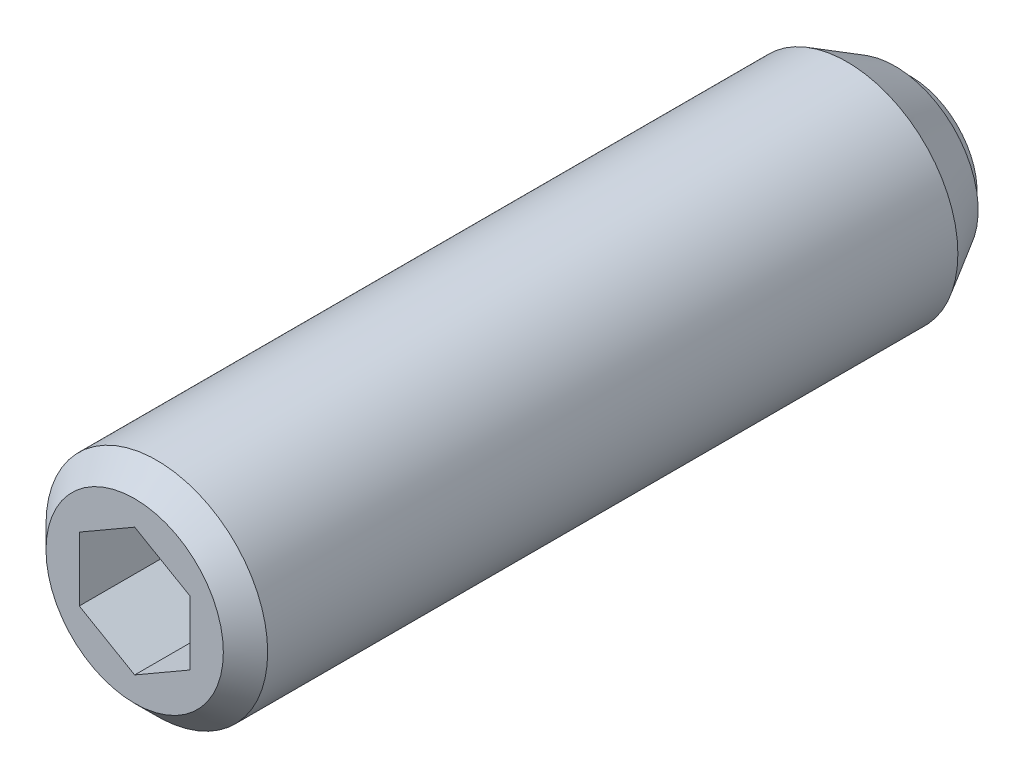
ISO-10303-21;
HEADER;
FILE_DESCRIPTION(('STEP AP214'),'2;1');
FILE_NAME('part.step','',(''),(''),'','','');
FILE_SCHEMA(('AUTOMOTIVE_DESIGN { 1 0 10303 214 1 1 1 1 }'));
ENDSEC;
DATA;
#1=APPLICATION_CONTEXT('core data for automotive mechanical design processes');
#2=APPLICATION_PROTOCOL_DEFINITION('international standard','automotive_design',2000,#1);
#3=PRODUCT_CONTEXT('',#1,'mechanical');
#4=PRODUCT('Part','Part','',(#3));
#5=PRODUCT_RELATED_PRODUCT_CATEGORY('part','',(#4));
#6=PRODUCT_DEFINITION_FORMATION('','',#4);
#7=PRODUCT_DEFINITION_CONTEXT('part definition',#1,'design');
#8=PRODUCT_DEFINITION('design','',#6,#7);
#9=PRODUCT_DEFINITION_SHAPE('','',#8);
#10=(LENGTH_UNIT() NAMED_UNIT(*) SI_UNIT(.MILLI.,.METRE.));
#11=(NAMED_UNIT(*) PLANE_ANGLE_UNIT() SI_UNIT($,.RADIAN.));
#12=(NAMED_UNIT(*) SI_UNIT($,.STERADIAN.) SOLID_ANGLE_UNIT());
#13=UNCERTAINTY_MEASURE_WITH_UNIT(LENGTH_MEASURE(1.E-05),#10,'distance_accuracy_value','');
#14=(GEOMETRIC_REPRESENTATION_CONTEXT(3) GLOBAL_UNCERTAINTY_ASSIGNED_CONTEXT((#13)) GLOBAL_UNIT_ASSIGNED_CONTEXT((#10,
#11,#12)) REPRESENTATION_CONTEXT('',''));
#15=CARTESIAN_POINT('',(0.,0.,0.));
#16=DIRECTION('',(0.,0.,1.));
#17=DIRECTION('',(1.,0.,0.));
#18=AXIS2_PLACEMENT_3D('',#15,#16,#17);
#19=CARTESIAN_POINT('',(2.5,1.44337567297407,32.5));
#20=DIRECTION('',(0.5,0.86602540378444,0.));
#21=DIRECTION('',(0.86602540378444,-0.5,0.));
#22=AXIS2_PLACEMENT_3D('',#19,#20,#21);
#23=PLANE('',#22);
#24=DIRECTION('',(0.,0.,1.));
#25=VECTOR('',#24,1.);
#26=CARTESIAN_POINT('',(2.5,1.44337567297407,32.5));
#27=LINE('',#26,#25);
#28=CARTESIAN_POINT('',(2.5,1.44337567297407,31.));
#29=VERTEX_POINT('',#28);
#30=CARTESIAN_POINT('',(2.5,1.44337567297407,35.));
#31=VERTEX_POINT('',#30);
#32=EDGE_CURVE('E68',#29,#31,#27,.T.);
#33=ORIENTED_EDGE('',*,*,#32,.T.);
#34=DIRECTION('',(-0.86602540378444,0.5,0.));
#35=VECTOR('',#34,1.);
#36=CARTESIAN_POINT('',(2.5,1.44337567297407,35.));
#37=LINE('',#36,#35);
#38=CARTESIAN_POINT('',(0.,2.88675134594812,35.));
#39=VERTEX_POINT('',#38);
#40=EDGE_CURVE('E29',#31,#39,#37,.T.);
#41=ORIENTED_EDGE('',*,*,#40,.T.);
#42=DIRECTION('',(0.,0.,1.));
#43=VECTOR('',#42,1.);
#44=CARTESIAN_POINT('',(0.,2.88675134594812,32.5));
#45=LINE('',#44,#43);
#46=CARTESIAN_POINT('',(0.,2.88675134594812,31.));
#47=VERTEX_POINT('',#46);
#48=EDGE_CURVE('E80',#47,#39,#45,.T.);
#49=ORIENTED_EDGE('',*,*,#48,.F.);
#50=DIRECTION('',(-0.86602540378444,0.5,0.));
#51=VECTOR('',#50,1.);
#52=CARTESIAN_POINT('',(2.5,1.44337567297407,31.));
#53=LINE('',#52,#51);
#54=EDGE_CURVE('E79',#29,#47,#53,.T.);
#55=ORIENTED_EDGE('',*,*,#54,.F.);
#56=EDGE_LOOP('',(#33,#41,#49,#55));
#57=FACE_BOUND('',#56,.T.);
#58=ADVANCED_FACE('F14',(#57),#23,.F.);
#59=CARTESIAN_POINT('',(2.5,-1.44337567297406,32.5));
#60=DIRECTION('',(1.,0.,0.));
#61=DIRECTION('',(0.,-1.,0.));
#62=AXIS2_PLACEMENT_3D('',#59,#60,#61);
#63=PLANE('',#62);
#64=DIRECTION('',(0.,0.,1.));
#65=VECTOR('',#64,1.);
#66=CARTESIAN_POINT('',(2.5,-1.44337567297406,32.5));
#67=LINE('',#66,#65);
#68=CARTESIAN_POINT('',(2.5,-1.44337567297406,31.));
#69=VERTEX_POINT('',#68);
#70=CARTESIAN_POINT('',(2.5,-1.44337567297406,35.));
#71=VERTEX_POINT('',#70);
#72=EDGE_CURVE('E76',#69,#71,#67,.T.);
#73=ORIENTED_EDGE('',*,*,#72,.T.);
#74=DIRECTION('',(0.,1.,0.));
#75=VECTOR('',#74,1.);
#76=CARTESIAN_POINT('',(2.5,-1.44337567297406,35.));
#77=LINE('',#76,#75);
#78=EDGE_CURVE('E75',#71,#31,#77,.T.);
#79=ORIENTED_EDGE('',*,*,#78,.T.);
#80=ORIENTED_EDGE('',*,*,#32,.F.);
#81=DIRECTION('',(0.,1.,0.));
#82=VECTOR('',#81,1.);
#83=CARTESIAN_POINT('',(2.5,-1.44337567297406,31.));
#84=LINE('',#83,#82);
#85=EDGE_CURVE('E72',#69,#29,#84,.T.);
#86=ORIENTED_EDGE('',*,*,#85,.F.);
#87=EDGE_LOOP('',(#73,#79,#80,#86));
#88=FACE_BOUND('',#87,.T.);
#89=ADVANCED_FACE('F70',(#88),#63,.F.);
#90=CARTESIAN_POINT('',(2.5,-1.44337567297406,32.5));
#91=DIRECTION('',(-0.5,0.866025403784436,0.));
#92=DIRECTION('',(0.866025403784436,0.5,0.));
#93=AXIS2_PLACEMENT_3D('',#90,#91,#92);
#94=PLANE('',#93);
#95=DIRECTION('',(0.,0.,1.));
#96=VECTOR('',#95,1.);
#97=CARTESIAN_POINT('',(0.,-2.88675134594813,32.5));
#98=LINE('',#97,#96);
#99=CARTESIAN_POINT('',(0.,-2.88675134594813,31.));
#100=VERTEX_POINT('',#99);
#101=CARTESIAN_POINT('',(0.,-2.88675134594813,35.));
#102=VERTEX_POINT('',#101);
#103=EDGE_CURVE('E122',#100,#102,#98,.T.);
#104=ORIENTED_EDGE('',*,*,#103,.T.);
#105=DIRECTION('',(-0.866025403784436,-0.5,0.));
#106=VECTOR('',#105,1.);
#107=CARTESIAN_POINT('',(2.5,-1.44337567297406,35.));
#108=LINE('',#107,#106);
#109=EDGE_CURVE('E113',#71,#102,#108,.T.);
#110=ORIENTED_EDGE('',*,*,#109,.F.);
#111=ORIENTED_EDGE('',*,*,#72,.F.);
#112=DIRECTION('',(0.866025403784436,0.5,0.));
#113=VECTOR('',#112,1.);
#114=CARTESIAN_POINT('',(0.,-2.88675134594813,31.));
#115=LINE('',#114,#113);
#116=EDGE_CURVE('E89',#100,#69,#115,.T.);
#117=ORIENTED_EDGE('',*,*,#116,.F.);
#118=EDGE_LOOP('',(#104,#110,#111,#117));
#119=FACE_BOUND('',#118,.T.);
#120=ADVANCED_FACE('F147',(#119),#94,.T.);
#121=CARTESIAN_POINT('',(-2.5,-1.44337567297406,32.5));
#122=DIRECTION('',(-0.5,-0.866025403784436,0.));
#123=DIRECTION('',(-0.866025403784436,0.5,0.));
#124=AXIS2_PLACEMENT_3D('',#121,#122,#123);
#125=PLANE('',#124);
#126=DIRECTION('',(0.,0.,1.));
#127=VECTOR('',#126,1.);
#128=CARTESIAN_POINT('',(-2.5,-1.44337567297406,32.5));
#129=LINE('',#128,#127);
#130=CARTESIAN_POINT('',(-2.5,-1.44337567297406,31.));
#131=VERTEX_POINT('',#130);
#132=CARTESIAN_POINT('',(-2.5,-1.44337567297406,35.));
#133=VERTEX_POINT('',#132);
#134=EDGE_CURVE('E120',#131,#133,#129,.T.);
#135=ORIENTED_EDGE('',*,*,#134,.T.);
#136=DIRECTION('',(0.866025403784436,-0.5,0.));
#137=VECTOR('',#136,1.);
#138=CARTESIAN_POINT('',(-2.5,-1.44337567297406,35.));
#139=LINE('',#138,#137);
#140=EDGE_CURVE('E111',#133,#102,#139,.T.);
#141=ORIENTED_EDGE('',*,*,#140,.T.);
#142=ORIENTED_EDGE('',*,*,#103,.F.);
#143=DIRECTION('',(0.866025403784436,-0.5,0.));
#144=VECTOR('',#143,1.);
#145=CARTESIAN_POINT('',(-2.5,-1.44337567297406,31.));
#146=LINE('',#145,#144);
#147=EDGE_CURVE('E101',#131,#100,#146,.T.);
#148=ORIENTED_EDGE('',*,*,#147,.F.);
#149=EDGE_LOOP('',(#135,#141,#142,#148));
#150=FACE_BOUND('',#149,.T.);
#151=ADVANCED_FACE('F157',(#150),#125,.F.);
#152=CARTESIAN_POINT('',(-2.5,-1.44337567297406,32.5));
#153=DIRECTION('',(1.,0.,0.));
#154=DIRECTION('',(0.,-1.,0.));
#155=AXIS2_PLACEMENT_3D('',#152,#153,#154);
#156=PLANE('',#155);
#157=DIRECTION('',(0.,0.,1.));
#158=VECTOR('',#157,1.);
#159=CARTESIAN_POINT('',(-2.5,1.44337567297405,32.5));
#160=LINE('',#159,#158);
#161=CARTESIAN_POINT('',(-2.5,1.44337567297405,31.));
#162=VERTEX_POINT('',#161);
#163=CARTESIAN_POINT('',(-2.5,1.44337567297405,35.));
#164=VERTEX_POINT('',#163);
#165=EDGE_CURVE('E37',#162,#164,#160,.T.);
#166=ORIENTED_EDGE('',*,*,#165,.T.);
#167=DIRECTION('',(0.,1.,0.));
#168=VECTOR('',#167,1.);
#169=CARTESIAN_POINT('',(-2.5,-1.44337567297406,35.));
#170=LINE('',#169,#168);
#171=EDGE_CURVE('E108',#133,#164,#170,.T.);
#172=ORIENTED_EDGE('',*,*,#171,.F.);
#173=ORIENTED_EDGE('',*,*,#134,.F.);
#174=DIRECTION('',(0.,-1.,0.));
#175=VECTOR('',#174,1.);
#176=CARTESIAN_POINT('',(-2.5,1.44337567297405,31.));
#177=LINE('',#176,#175);
#178=EDGE_CURVE('E98',#162,#131,#177,.T.);
#179=ORIENTED_EDGE('',*,*,#178,.F.);
#180=EDGE_LOOP('',(#166,#172,#173,#179));
#181=FACE_BOUND('',#180,.T.);
#182=ADVANCED_FACE('F153',(#181),#156,.T.);
#183=CARTESIAN_POINT('',(-2.5,1.44337567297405,32.5));
#184=DIRECTION('',(0.5,-0.866025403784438,0.));
#185=DIRECTION('',(-0.866025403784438,-0.5,0.));
#186=AXIS2_PLACEMENT_3D('',#183,#184,#185);
#187=PLANE('',#186);
#188=ORIENTED_EDGE('',*,*,#165,.F.);
#189=DIRECTION('',(-0.866025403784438,-0.5,0.));
#190=VECTOR('',#189,1.);
#191=CARTESIAN_POINT('',(0.,2.88675134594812,31.));
#192=LINE('',#191,#190);
#193=EDGE_CURVE('E84',#47,#162,#192,.T.);
#194=ORIENTED_EDGE('',*,*,#193,.F.);
#195=ORIENTED_EDGE('',*,*,#48,.T.);
#196=DIRECTION('',(0.866025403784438,0.5,0.));
#197=VECTOR('',#196,1.);
#198=CARTESIAN_POINT('',(-2.5,1.44337567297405,35.));
#199=LINE('',#198,#197);
#200=EDGE_CURVE('E105',#164,#39,#199,.T.);
#201=ORIENTED_EDGE('',*,*,#200,.F.);
#202=EDGE_LOOP('',(#188,#194,#195,#201));
#203=FACE_BOUND('',#202,.T.);
#204=ADVANCED_FACE('F150',(#203),#187,.T.);
#205=CARTESIAN_POINT('',(0.,0.,34.75));
#206=DIRECTION('',(0.,0.,-1.));
#207=DIRECTION('',(1.,0.,0.));
#208=AXIS2_PLACEMENT_3D('',#205,#206,#207);
#209=CYLINDRICAL_SURFACE('',#208,5.);
#210=CARTESIAN_POINT('',(0.,0.,34.));
#211=DIRECTION('',(0.,0.,-1.));
#212=DIRECTION('',(1.,0.,0.));
#213=AXIS2_PLACEMENT_3D('',#210,#211,#212);
#214=CIRCLE('',#213,5.);
#215=CARTESIAN_POINT('',(5.,0.,34.));
#216=VERTEX_POINT('',#215);
#217=EDGE_CURVE('E9',#216,#216,#214,.T.);
#218=ORIENTED_EDGE('',*,*,#217,.T.);
#219=EDGE_LOOP('',(#218));
#220=FACE_BOUND('',#219,.T.);
#221=CARTESIAN_POINT('',(0.,0.,2.86506350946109));
#222=DIRECTION('',(0.,0.,-1.));
#223=DIRECTION('',(-1.,0.,0.));
#224=AXIS2_PLACEMENT_3D('',#221,#222,#223);
#225=CIRCLE('',#224,5.);
#226=CARTESIAN_POINT('',(-5.,0.,2.86506350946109));
#227=VERTEX_POINT('',#226);
#228=EDGE_CURVE('E260',#227,#227,#225,.T.);
#229=ORIENTED_EDGE('',*,*,#228,.F.);
#230=EDGE_LOOP('',(#229));
#231=FACE_BOUND('',#230,.T.);
#232=ADVANCED_FACE('F16',(#220,#231),#209,.T.);
#233=CARTESIAN_POINT('',(0.,0.,34.));
#234=DIRECTION('',(0.,0.,-1.));
#235=DIRECTION('',(1.,0.,0.));
#236=AXIS2_PLACEMENT_3D('',#233,#234,#235);
#237=CONICAL_SURFACE('',#236,5.,0.785398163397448);
#238=CARTESIAN_POINT('',(0.,0.,35.));
#239=DIRECTION('',(0.,0.,-1.));
#240=DIRECTION('',(1.,0.,0.));
#241=AXIS2_PLACEMENT_3D('',#238,#239,#240);
#242=CIRCLE('',#241,4.);
#243=CARTESIAN_POINT('',(4.,0.,35.));
#244=VERTEX_POINT('',#243);
#245=EDGE_CURVE('E22',#244,#244,#242,.T.);
#246=ORIENTED_EDGE('',*,*,#245,.T.);
#247=EDGE_LOOP('',(#246));
#248=FACE_BOUND('',#247,.T.);
#249=ORIENTED_EDGE('',*,*,#217,.F.);
#250=EDGE_LOOP('',(#249));
#251=FACE_BOUND('',#250,.T.);
#252=ADVANCED_FACE('F127',(#248,#251),#237,.T.);
#253=CARTESIAN_POINT('',(0.,0.,35.));
#254=DIRECTION('',(0.,0.,-1.));
#255=DIRECTION('',(1.,0.,0.));
#256=AXIS2_PLACEMENT_3D('',#253,#254,#255);
#257=PLANE('',#256);
#258=ORIENTED_EDGE('',*,*,#200,.T.);
#259=ORIENTED_EDGE('',*,*,#40,.F.);
#260=ORIENTED_EDGE('',*,*,#78,.F.);
#261=ORIENTED_EDGE('',*,*,#109,.T.);
#262=ORIENTED_EDGE('',*,*,#140,.F.);
#263=ORIENTED_EDGE('',*,*,#171,.T.);
#264=EDGE_LOOP('',(#258,#259,#260,#261,#262,#263));
#265=FACE_BOUND('',#264,.T.);
#266=ORIENTED_EDGE('',*,*,#245,.F.);
#267=EDGE_LOOP('',(#266));
#268=FACE_BOUND('',#267,.T.);
#269=ADVANCED_FACE('F130',(#265,#268),#257,.F.);
#270=CARTESIAN_POINT('',(2.5,1.44337567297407,31.));
#271=DIRECTION('',(0.,0.,1.));
#272=DIRECTION('',(1.,0.,0.));
#273=AXIS2_PLACEMENT_3D('',#270,#271,#272);
#274=PLANE('',#273);
#275=ORIENTED_EDGE('',*,*,#85,.T.);
#276=ORIENTED_EDGE('',*,*,#54,.T.);
#277=ORIENTED_EDGE('',*,*,#193,.T.);
#278=ORIENTED_EDGE('',*,*,#178,.T.);
#279=ORIENTED_EDGE('',*,*,#147,.T.);
#280=ORIENTED_EDGE('',*,*,#116,.T.);
#281=EDGE_LOOP('',(#275,#276,#277,#278,#279,#280));
#282=FACE_BOUND('',#281,.T.);
#283=ADVANCED_FACE('F86',(#282),#274,.T.);
#284=CARTESIAN_POINT('',(0.,0.,0.));
#285=DIRECTION('',(0.,0.,-1.));
#286=DIRECTION('',(-1.,0.,0.));
#287=AXIS2_PLACEMENT_3D('',#284,#285,#286);
#288=PLANE('',#287);
#289=CARTESIAN_POINT('',(0.,0.,0.));
#290=DIRECTION('',(0.,0.,-1.));
#291=DIRECTION('',(-1.,0.,0.));
#292=AXIS2_PLACEMENT_3D('',#289,#290,#291);
#293=CIRCLE('',#292,3.00166620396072);
#294=CARTESIAN_POINT('',(-3.00166620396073,0.,0.));
#295=VERTEX_POINT('',#294);
#296=EDGE_CURVE('E90',#295,#295,#293,.T.);
#297=ORIENTED_EDGE('',*,*,#296,.T.);
#298=EDGE_LOOP('',(#297));
#299=FACE_BOUND('',#298,.T.);
#300=ADVANCED_FACE('F139',(#299),#288,.T.);
#301=CARTESIAN_POINT('',(0.,0.,1.8));
#302=DIRECTION('',(0.,0.,-1.));
#303=DIRECTION('',(-1.,0.,0.));
#304=AXIS2_PLACEMENT_3D('',#301,#302,#303);
#305=SPHERICAL_SURFACE('',#304,3.5);
#306=CARTESIAN_POINT('',(0.,0.,0.7));
#307=DIRECTION('',(0.,0.,-1.));
#308=DIRECTION('',(-1.,0.,0.));
#309=AXIS2_PLACEMENT_3D('',#306,#307,#308);
#310=CIRCLE('',#309,3.32264954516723);
#311=CARTESIAN_POINT('',(-3.32264954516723,0.,0.7));
#312=VERTEX_POINT('',#311);
#313=EDGE_CURVE('E93',#312,#312,#310,.T.);
#314=CARTESIAN_POINT('',(-3.32264954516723,0.,0.7));
#315=CARTESIAN_POINT('',(-3.32012332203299,0.,0.692369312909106));
#316=CARTESIAN_POINT('',(-3.31757081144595,0.,0.68474732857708));
#317=CARTESIAN_POINT('',(-3.31241333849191,0.,0.669521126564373));
#318=CARTESIAN_POINT('',(-3.30980837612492,0.,0.661916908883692));
#319=CARTESIAN_POINT('',(-3.30454612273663,0.,0.646726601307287));
#320=CARTESIAN_POINT('',(-3.30188883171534,0.,0.639140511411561));
#321=CARTESIAN_POINT('',(-3.29652204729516,0.,0.623986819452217));
#322=CARTESIAN_POINT('',(-3.29381255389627,0.,0.616419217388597));
#323=CARTESIAN_POINT('',(-3.28834149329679,0.,0.601302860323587));
#324=CARTESIAN_POINT('',(-3.28557992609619,0.,0.593754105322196));
#325=CARTESIAN_POINT('',(-3.28000484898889,0.,0.578675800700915));
#326=CARTESIAN_POINT('',(-3.27719133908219,0.,0.571146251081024));
#327=CARTESIAN_POINT('',(-3.27151251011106,0.,0.556106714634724));
#328=CARTESIAN_POINT('',(-3.26864719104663,0.,0.548596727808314));
#329=CARTESIAN_POINT('',(-3.26286487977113,0.,0.533596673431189));
#330=CARTESIAN_POINT('',(-3.25994788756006,0.,0.526106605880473));
#331=CARTESIAN_POINT('',(-3.25406236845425,0.,0.511146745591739));
#332=CARTESIAN_POINT('',(-3.25109384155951,0.,0.503676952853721));
#333=CARTESIAN_POINT('',(-3.24510539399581,0.,0.488757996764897));
#334=CARTESIAN_POINT('',(-3.24208547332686,0.,0.481308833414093));
#335=CARTESIAN_POINT('',(-3.23599438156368,0.,0.466431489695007));
#336=CARTESIAN_POINT('',(-3.23292321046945,0.,0.459003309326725));
#337=CARTESIAN_POINT('',(-3.22672976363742,0.,0.444168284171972));
#338=CARTESIAN_POINT('',(-3.22360748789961,0.,0.436761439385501));
#339=CARTESIAN_POINT('',(-3.21731197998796,0.,0.421969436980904));
#340=CARTESIAN_POINT('',(-3.2141387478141,0.,0.414584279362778));
#341=CARTESIAN_POINT('',(-3.20774147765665,0.,0.399836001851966));
#342=CARTESIAN_POINT('',(-3.20451743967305,0.,0.39247288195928));
#343=CARTESIAN_POINT('',(-3.19801871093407,0.,0.377769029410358));
#344=CARTESIAN_POINT('',(-3.19474402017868,0.,0.370428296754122));
#345=CARTESIAN_POINT('',(-3.18814414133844,0.,0.35576956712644));
#346=CARTESIAN_POINT('',(-3.18481895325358,0.,0.348451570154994));
#347=CARTESIAN_POINT('',(-3.17811823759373,0.,0.333838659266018));
#348=CARTESIAN_POINT('',(-3.17474271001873,0.,0.326543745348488));
#349=CARTESIAN_POINT('',(-3.16794147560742,0.,0.311977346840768));
#350=CARTESIAN_POINT('',(-3.1645157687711,0.,0.304705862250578));
#351=CARTESIAN_POINT('',(-3.15761433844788,0.,0.290186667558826));
#352=CARTESIAN_POINT('',(-3.15413861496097,0.,0.282938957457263));
#353=CARTESIAN_POINT('',(-3.14713731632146,0.,0.268467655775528));
#354=CARTESIAN_POINT('',(-3.14361174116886,0.,0.261244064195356));
#355=CARTESIAN_POINT('',(-3.13651090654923,0.,0.246821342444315));
#356=CARTESIAN_POINT('',(-3.13293564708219,0.,0.239622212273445));
#357=CARTESIAN_POINT('',(-3.12573561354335,0.,0.225248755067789));
#358=CARTESIAN_POINT('',(-3.12211083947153,0.,0.218074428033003));
#359=CARTESIAN_POINT('',(-3.11481194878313,0.,0.203750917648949));
#360=CARTESIAN_POINT('',(-3.11113783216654,0.,0.196601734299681));
#361=CARTESIAN_POINT('',(-3.10374043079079,0.,0.182328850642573));
#362=CARTESIAN_POINT('',(-3.10001714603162,0.,0.175205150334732));
#363=CARTESIAN_POINT('',(-3.09252158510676,0.,0.1609835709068));
#364=CARTESIAN_POINT('',(-3.08874930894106,0.,0.153885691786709));
#365=CARTESIAN_POINT('',(-3.08115594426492,0.,0.139716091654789));
#366=CARTESIAN_POINT('',(-3.07733485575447,0.,0.13264437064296));
#367=CARTESIAN_POINT('',(-3.06964404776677,0.,0.118527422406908));
#368=CARTESIAN_POINT('',(-3.06577432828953,0.,0.111482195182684));
#369=CARTESIAN_POINT('',(-3.05798644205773,0.,0.0974185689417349));
#370=CARTESIAN_POINT('',(-3.05406827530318,0.,0.0904001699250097));
#371=CARTESIAN_POINT('',(-3.04618368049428,0.,0.0763905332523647));
#372=CARTESIAN_POINT('',(-3.04221725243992,0.,0.0693992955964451));
#373=CARTESIAN_POINT('',(-3.03423632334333,0.,0.0554443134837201));
#374=CARTESIAN_POINT('',(-3.03022182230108,0.,0.0484805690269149));
#375=CARTESIAN_POINT('',(-3.02214493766,0.,0.0345809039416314));
#376=CARTESIAN_POINT('',(-3.01808255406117,0.,0.0276449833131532));
#377=CARTESIAN_POINT('',(-3.00991009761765,0.,0.0138012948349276));
#378=CARTESIAN_POINT('',(-3.00580002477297,0.,0.00689352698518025));
#379=CARTESIAN_POINT('',(-3.00166620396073,0.,0.));
#380=B_SPLINE_CURVE_WITH_KNOTS('',3,(#314,#315,#316,#317,#318,#319,#320,#321,#322,#323,#324,
#325,#326,#327,#328,#329,#330,#331,#332,#333,#334,#335,#336,#337,#338,#339,#340,#341,#342,#343,
#344,#345,#346,#347,#348,#349,#350,#351,#352,#353,#354,#355,#356,#357,#358,#359,#360,#361,#362,
#363,#364,#365,#366,#367,#368,#369,#370,#371,#372,#373,#374,#375,#376,#377,#378,#379),
.UNSPECIFIED.,.F.,.F.,(4,2,2,2,2,2,2,2,2,2,2,2,2,2,2,2,2,2,2,2,2,2,2,2,2,2,2,2,2,2,2,2,4),(0.,
0.0241139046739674,0.048227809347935,0.0723417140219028,0.0964556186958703,0.120569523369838,
0.144683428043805,0.168797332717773,0.192911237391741,0.217025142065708,0.241139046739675,
0.265252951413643,0.289366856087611,0.313480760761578,0.337594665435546,0.361708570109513,
0.385822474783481,0.409936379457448,0.434050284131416,0.458164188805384,0.482278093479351,
0.506391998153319,0.530505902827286,0.554619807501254,0.578733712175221,0.602847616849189,
0.626961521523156,0.651075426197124,0.675189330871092,0.699303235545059,0.723417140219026,
0.747531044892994,0.771644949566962),.UNSPECIFIED.);
#381=EDGE_CURVE('BSEAM223',#312,#295,#380,.T.);
#382=ORIENTED_EDGE('',*,*,#313,.T.);
#383=ORIENTED_EDGE('',*,*,#296,.F.);
#384=ORIENTED_EDGE('',*,*,#381,.T.);
#385=ORIENTED_EDGE('',*,*,#381,.F.);
#386=EDGE_LOOP('',(#382,#384,#383,#385));
#387=FACE_BOUND('',#386,.T.);
#388=ADVANCED_FACE('F223',(#387),#305,.T.);
#389=CARTESIAN_POINT('',(-3.32264954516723,0.,0.7));
#390=DIRECTION('',(0.,0.,-1.));
#391=DIRECTION('',(-1.,0.,0.));
#392=AXIS2_PLACEMENT_3D('',#389,#390,#391);
#393=PLANE('',#392);
#394=CARTESIAN_POINT('',(0.,0.,0.7));
#395=DIRECTION('',(0.,0.,-1.));
#396=DIRECTION('',(-1.,0.,0.));
#397=AXIS2_PLACEMENT_3D('',#394,#395,#396);
#398=CIRCLE('',#397,3.75);
#399=CARTESIAN_POINT('',(-3.75,0.,0.7));
#400=VERTEX_POINT('',#399);
#401=EDGE_CURVE('E263',#400,#400,#398,.T.);
#402=ORIENTED_EDGE('',*,*,#401,.T.);
#403=EDGE_LOOP('',(#402));
#404=FACE_BOUND('',#403,.T.);
#405=ORIENTED_EDGE('',*,*,#313,.F.);
#406=EDGE_LOOP('',(#405));
#407=FACE_BOUND('',#406,.T.);
#408=ADVANCED_FACE('F232',(#404,#407),#393,.T.);
#409=CARTESIAN_POINT('',(0.,0.,0.7));
#410=DIRECTION('',(0.,0.,1.));
#411=DIRECTION('',(1.,0.,0.));
#412=AXIS2_PLACEMENT_3D('',#409,#410,#411);
#413=CONICAL_SURFACE('',#412,3.75,0.523598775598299);
#414=ORIENTED_EDGE('',*,*,#228,.T.);
#415=EDGE_LOOP('',(#414));
#416=FACE_BOUND('',#415,.T.);
#417=ORIENTED_EDGE('',*,*,#401,.F.);
#418=EDGE_LOOP('',(#417));
#419=FACE_BOUND('',#418,.T.);
#420=ADVANCED_FACE('F242',(#416,#419),#413,.T.);
#421=CLOSED_SHELL('',(#58,#89,#120,#151,#182,#204,#232,#252,#269,#283,#300,#388,#408,#420));
#422=MANIFOLD_SOLID_BREP('B1',#421);
#423=ADVANCED_BREP_SHAPE_REPRESENTATION('',(#18,#422),#14);
#424=SHAPE_DEFINITION_REPRESENTATION(#9,#423);
ENDSEC;
END-ISO-10303-21;
